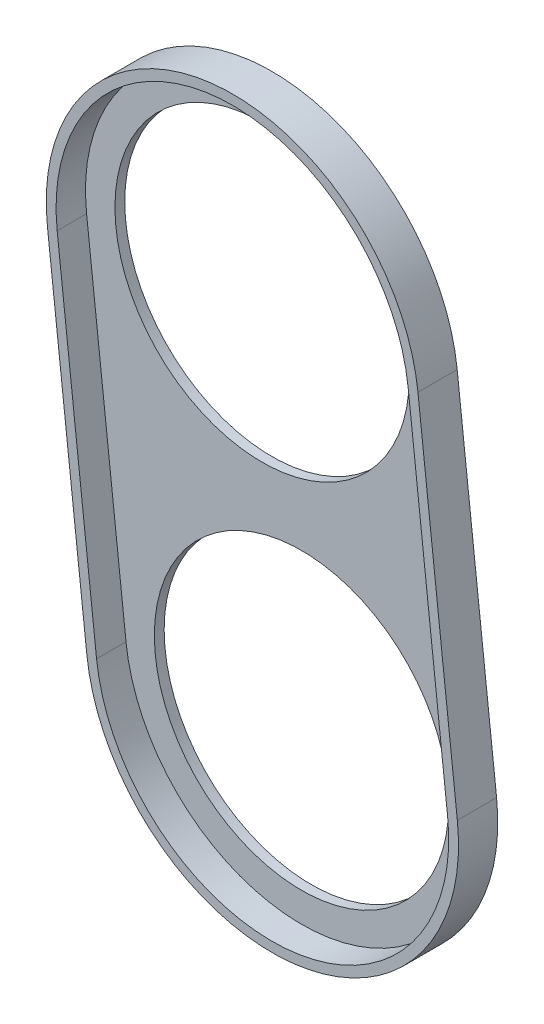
from build123d import *

# Parameters (mm, degrees)
BOSS_EXTRU_1_DEPTH      = 10
ENL_V_MAT_EXTRU_1_DEPTH = 7.5
ESQUISSE4_R             = 37.5
ENL_V_MAT_EXTRU_2_DEPTH = 149.725687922


with BuildPart() as part:
    # Esquisse1 → Boss.-Extru.1 (new body)
    with BuildSketch(Plane.XY):
        with BuildLine():
            Line((-47.203410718, -5.299812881), (-37.161659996, -94.737854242))
            ThreePointArc((-37.161659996, -94.737854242), (15.341563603, -136.641452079), (57.24516144, -84.138228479))
            Line((57.24516144, -84.138228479), (47.203410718, 5.299812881))
            ThreePointArc((47.203410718, 5.299812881), (-5.299812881, 47.203410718), (-47.203410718, -5.299812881))
        make_face()
    extrude(amount=BOSS_EXTRU_1_DEPTH)

    # Esquisse3 → Enl_v. mat.-Extru.1 (cut)
    with BuildSketch(Plane.XY.offset(10)):
        with BuildLine():
            Line((54.760771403, -84.417166), (44.71902068, 5.020875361))
            ThreePointArc((44.71902068, 5.020875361), (-5.020875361, 44.71902068), (-44.71902068, -5.020875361))
            Line((-44.71902068, -5.020875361), (-34.677269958, -94.458916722))
            ThreePointArc((-34.677269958, -94.458916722), (15.062626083, -134.157062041), (54.760771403, -84.417166))
        make_face()
    extrude(amount=-ENL_V_MAT_EXTRU_1_DEPTH, mode=Mode.SUBTRACT)

    # Esquisse4 → Enl_v. mat.-Extru.2 (cut, through all)
    with BuildSketch(Plane.XY.offset(2.5)):
        Circle(ESQUISSE4_R)
        with Locations((10.041750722, -89.438041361)):
            Circle(ESQUISSE4_R)
    extrude(amount=-ENL_V_MAT_EXTRU_2_DEPTH, mode=Mode.SUBTRACT)


solid = part.part
